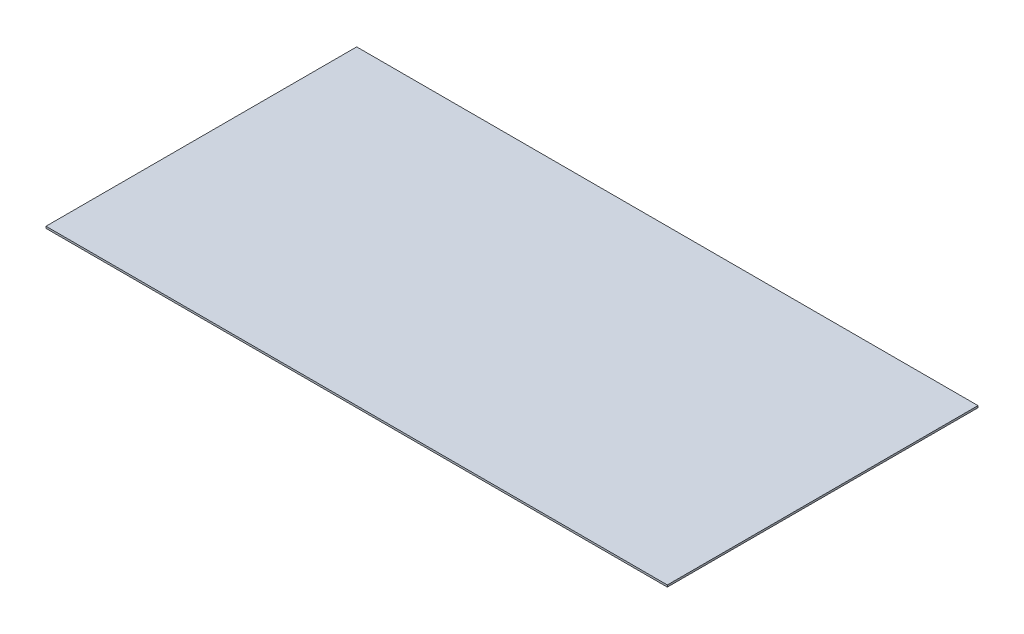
from build123d import *

# Parameters (mm, degrees)
L_U_BR_W             = 980
L_U_BR_H             = 490
AUFSATZ_LIN_GK_DEPTH = 3


with BuildPart() as part:
    # L_ u Br → Aufsatz-Lin_GK (new body)
    with BuildSketch(Plane(origin=(0, 0, 0), x_dir=(1, 0, 0), z_dir=(0, 1, 0))):
        with Locations((0, 245)):
            Rectangle(L_U_BR_W, L_U_BR_H)
    extrude(amount=AUFSATZ_LIN_GK_DEPTH)


solid = part.part
